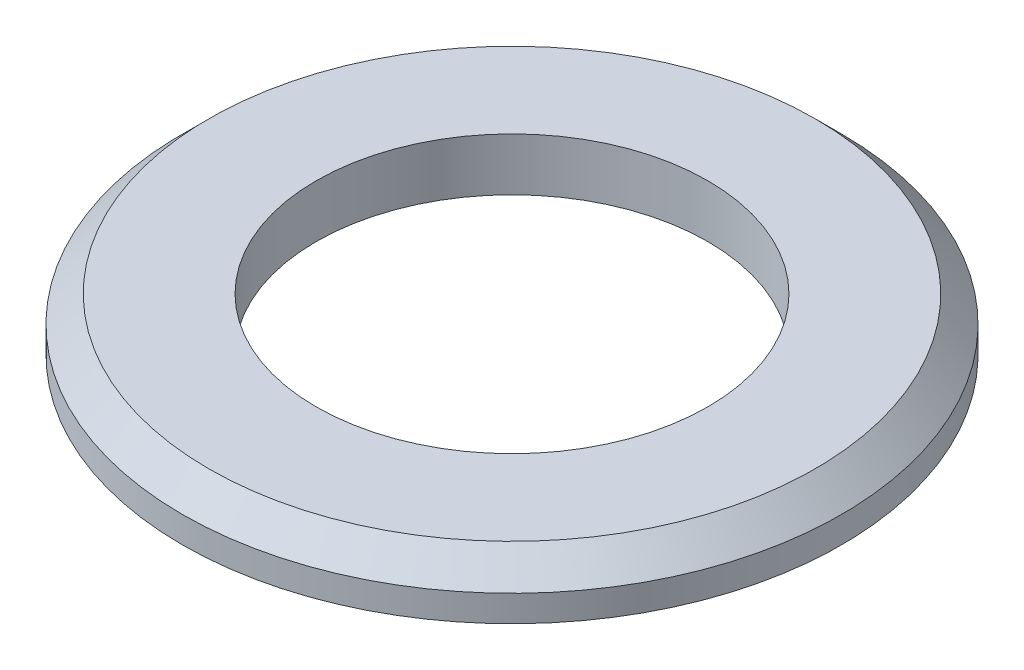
from build123d import *

# Parameters (mm, degrees)
SKETCH1_R      = 87.5
SKETCH1_R_2    = 52
EXTRUDE1_DEPTH = 14
CHAMFER1_SIZE  = 7


with BuildPart() as part:
    # Sketch1 → Extrude1 (new body)
    with BuildSketch(Plane(origin=(0, 0, 0), x_dir=(1, 0, 0), z_dir=(0, 1, 0))):
        with Locations(Location((0, 0, 0), (0, 0, 270))):
            Circle(SKETCH1_R)
        with Locations(Location((0, 0, 0), (0, 0, 270))):
            Circle(SKETCH1_R_2, mode=Mode.SUBTRACT)
    extrude(amount=EXTRUDE1_DEPTH)

    # Chamfer1
    chamfer1_edges = [part.edges().sort_by_distance(p)[0] for p in [
        (0, 14, -87.5),
    ]]
    chamfer(chamfer1_edges, length=CHAMFER1_SIZE)


solid = part.part
